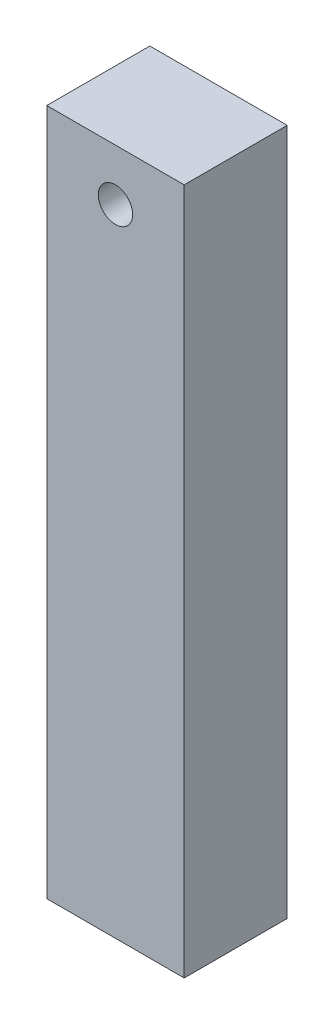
from build123d import *

# Parameters (mm, degrees)
ESQUISSE1_W             = 8
ESQUISSE1_H             = 6
EXTRUSION1_DEPTH        = 40
ESQUISSE2_R             = 1
ENL_V_MAT_EXTRU_1_DEPTH = 42.231056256


with BuildPart() as part:
    # Esquisse1 → Extrusion1 (new body)
    with BuildSketch(Plane(origin=(0, 0, 0), x_dir=(1, 0, 0), z_dir=(0, 1, 0))):
        with Locations((4, 3)):
            Rectangle(ESQUISSE1_W, ESQUISSE1_H)
    extrude(amount=EXTRUSION1_DEPTH)

    # Esquisse2 → Enl_v. mat.-Extru.1 (cut, through all)
    with BuildSketch(Plane.XY):
        with Locations((4, 37)):
            Circle(ESQUISSE2_R)
    extrude(amount=-ENL_V_MAT_EXTRU_1_DEPTH, mode=Mode.SUBTRACT)


solid = part.part
